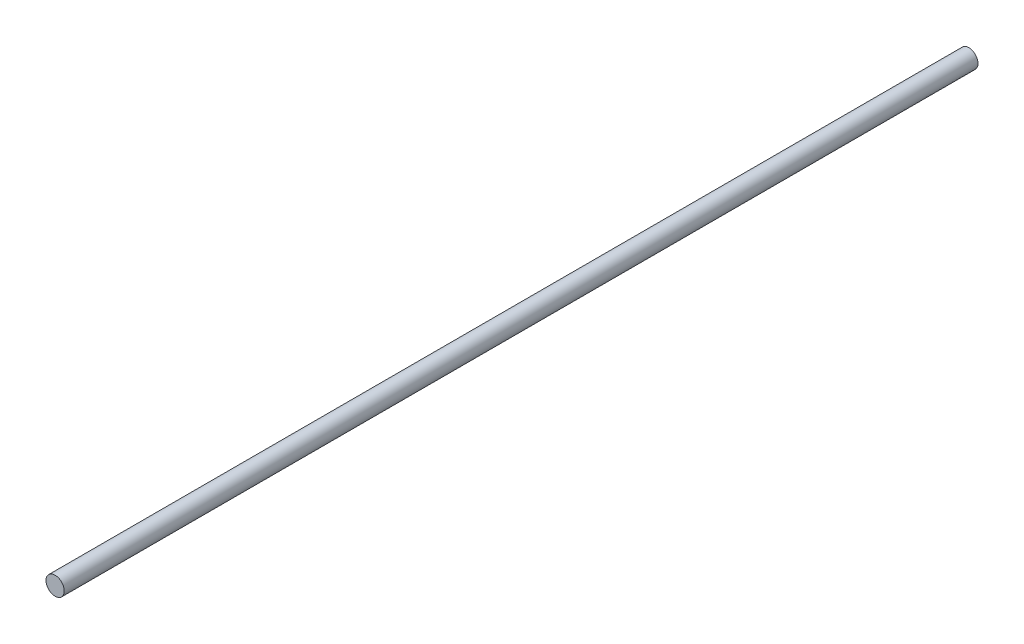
from build123d import *

# Parameters (mm, degrees)
SKETCH1_R           = 30
BOSS_EXTRUDE1_DEPTH = 3000


with BuildPart() as part:
    # Sketch1 → Boss-Extrude1 (new body)
    with BuildSketch(Plane.XY):
        Circle(SKETCH1_R)
    extrude(amount=-BOSS_EXTRUDE1_DEPTH)


solid = part.part
